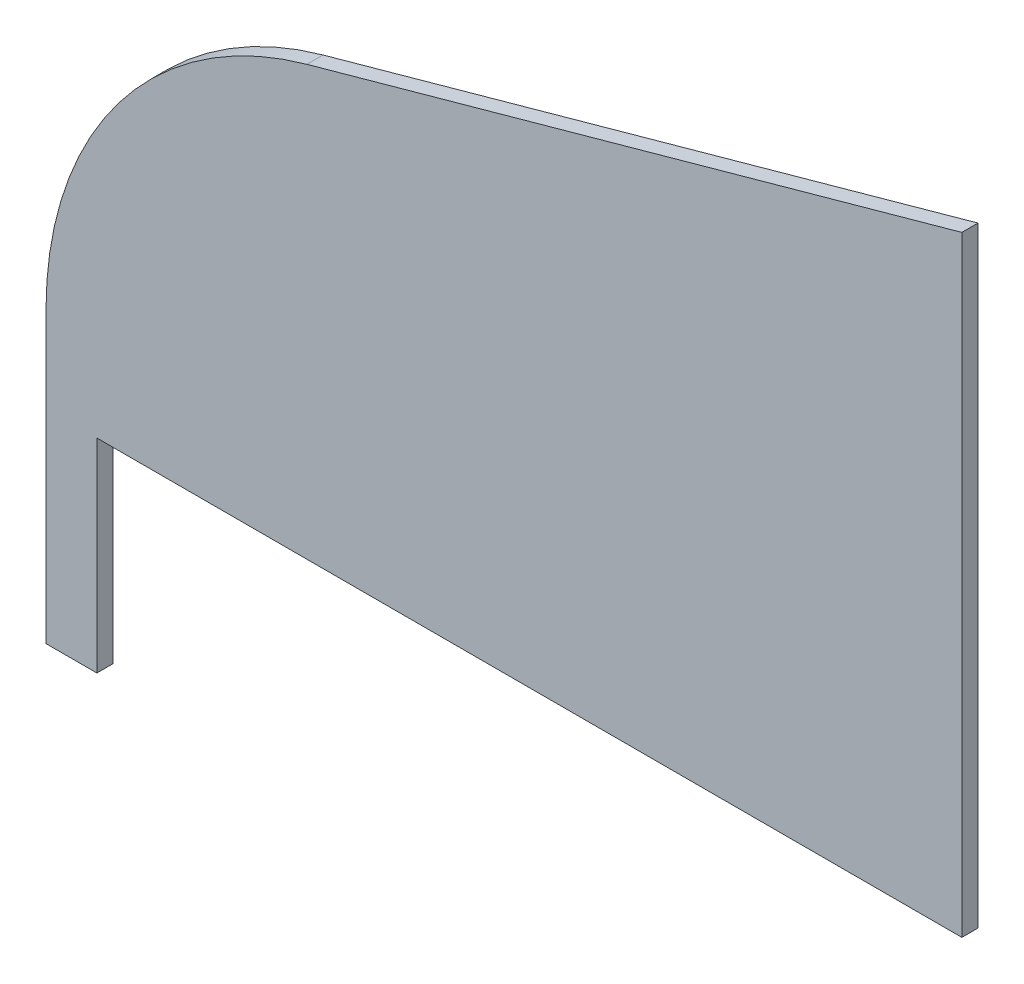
from build123d import *

# Parameters (mm, degrees)
BOSS_EXTRUDE1_DEPTH = 3.175


with BuildPart() as part:
    # Sketch1 → Boss-Extrude1 (new body)
    with BuildSketch(Plane.XY):
        with BuildLine():
            Line((0, 0), (0, 70))
            Line((0, 70), (-128.735070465, 34.240258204))
            ThreePointArc((-128.735070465, 34.240258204), (-165.729054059, 9.152858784), (-180, -33.20599547))
            Line((-180, -33.20599547), (-180, -90))
            Line((-180, -90), (-170, -90))
            Line((-170, -90), (-170, -50))
            Line((-170, -50), (0, -50))
            Line((0, -50), (0, 0))
        make_face()
    extrude(amount=BOSS_EXTRUDE1_DEPTH)


solid = part.part
